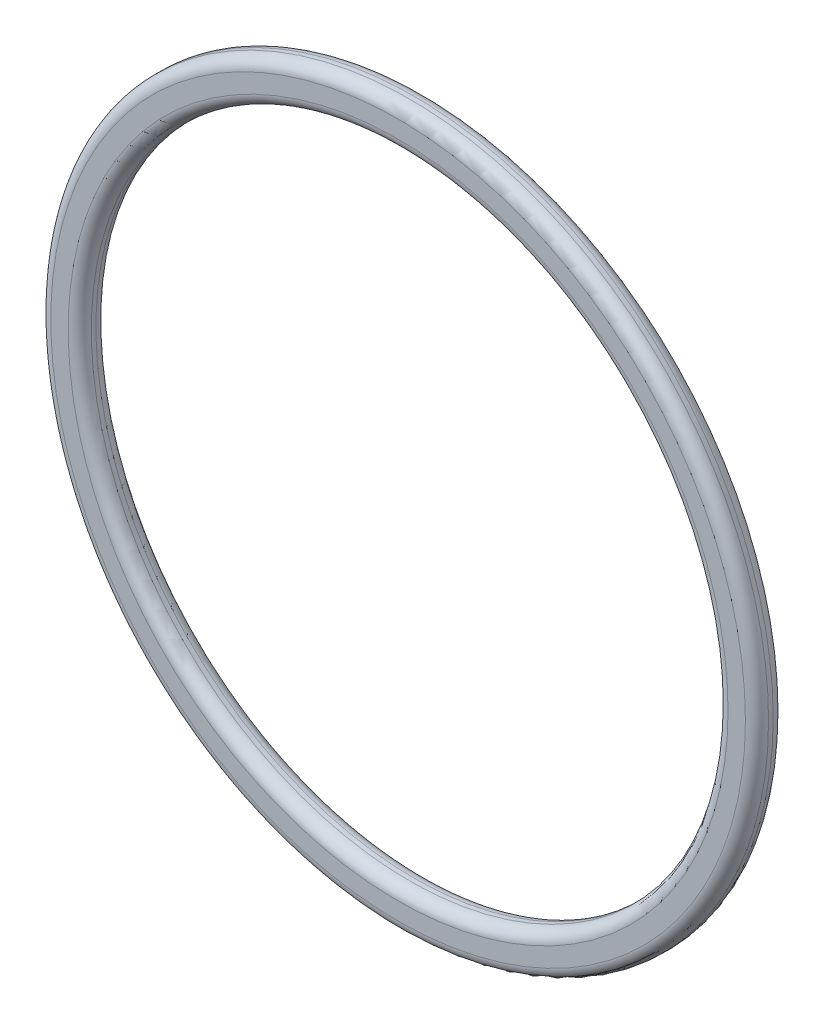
ISO-10303-21;
HEADER;
FILE_DESCRIPTION(('STEP AP214'),'2;1');
FILE_NAME('part.step','',(''),(''),'','','');
FILE_SCHEMA(('AUTOMOTIVE_DESIGN { 1 0 10303 214 1 1 1 1 }'));
ENDSEC;
DATA;
#1=APPLICATION_CONTEXT('core data for automotive mechanical design processes');
#2=APPLICATION_PROTOCOL_DEFINITION('international standard','automotive_design',2000,#1);
#3=PRODUCT_CONTEXT('',#1,'mechanical');
#4=PRODUCT('Part','Part','',(#3));
#5=PRODUCT_RELATED_PRODUCT_CATEGORY('part','',(#4));
#6=PRODUCT_DEFINITION_FORMATION('','',#4);
#7=PRODUCT_DEFINITION_CONTEXT('part definition',#1,'design');
#8=PRODUCT_DEFINITION('design','',#6,#7);
#9=PRODUCT_DEFINITION_SHAPE('','',#8);
#10=(LENGTH_UNIT() NAMED_UNIT(*) SI_UNIT(.MILLI.,.METRE.));
#11=(NAMED_UNIT(*) PLANE_ANGLE_UNIT() SI_UNIT($,.RADIAN.));
#12=(NAMED_UNIT(*) SI_UNIT($,.STERADIAN.) SOLID_ANGLE_UNIT());
#13=UNCERTAINTY_MEASURE_WITH_UNIT(LENGTH_MEASURE(1.E-05),#10,'distance_accuracy_value','');
#14=(GEOMETRIC_REPRESENTATION_CONTEXT(3) GLOBAL_UNCERTAINTY_ASSIGNED_CONTEXT((#13)) GLOBAL_UNIT_ASSIGNED_CONTEXT((#10,
#11,#12)) REPRESENTATION_CONTEXT('',''));
#15=CARTESIAN_POINT('',(0.,0.,0.));
#16=DIRECTION('',(0.,0.,1.));
#17=DIRECTION('',(1.,0.,0.));
#18=AXIS2_PLACEMENT_3D('',#15,#16,#17);
#19=CARTESIAN_POINT('',(0.,0.,-1.85936170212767));
#20=DIRECTION('',(0.,0.,1.));
#21=DIRECTION('',(1.,0.,0.));
#22=AXIS2_PLACEMENT_3D('',#19,#20,#21);
#23=TOROIDAL_SURFACE('',#22,28.5,1.);
#24=CARTESIAN_POINT('',(0.,0.,-2.85936170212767));
#25=DIRECTION('',(0.,0.,1.));
#26=DIRECTION('',(1.,0.,0.));
#27=AXIS2_PLACEMENT_3D('',#24,#25,#26);
#28=CIRCLE('',#27,28.5);
#29=CARTESIAN_POINT('',(28.5,0.,-2.85936170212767));
#30=VERTEX_POINT('',#29);
#31=EDGE_CURVE('E10',#30,#30,#28,.T.);
#32=ORIENTED_EDGE('',*,*,#31,.F.);
#33=EDGE_LOOP('',(#32));
#34=FACE_BOUND('',#33,.T.);
#35=CARTESIAN_POINT('',(0.,0.,-1.85936170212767));
#36=DIRECTION('',(0.,0.,1.));
#37=DIRECTION('',(1.,0.,0.));
#38=AXIS2_PLACEMENT_3D('',#35,#36,#37);
#39=CIRCLE('',#38,27.5);
#40=CARTESIAN_POINT('',(27.5,0.,-1.85936170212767));
#41=VERTEX_POINT('',#40);
#42=EDGE_CURVE('E56',#41,#41,#39,.T.);
#43=ORIENTED_EDGE('',*,*,#42,.T.);
#44=EDGE_LOOP('',(#43));
#45=FACE_BOUND('',#44,.T.);
#46=ADVANCED_FACE('F28',(#34,#45),#23,.T.);
#47=CARTESIAN_POINT('',(0.,30.,-2.85936170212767));
#48=DIRECTION('',(0.,0.,1.));
#49=DIRECTION('',(1.,0.,0.));
#50=AXIS2_PLACEMENT_3D('',#47,#48,#49);
#51=PLANE('',#50);
#52=CARTESIAN_POINT('',(0.,0.,-2.85936170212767));
#53=DIRECTION('',(0.,0.,1.));
#54=DIRECTION('',(1.,0.,0.));
#55=AXIS2_PLACEMENT_3D('',#52,#53,#54);
#56=CIRCLE('',#55,30.);
#57=CARTESIAN_POINT('',(30.,0.,-2.85936170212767));
#58=VERTEX_POINT('',#57);
#59=EDGE_CURVE('E34',#58,#58,#56,.T.);
#60=ORIENTED_EDGE('',*,*,#59,.F.);
#61=EDGE_LOOP('',(#60));
#62=FACE_BOUND('',#61,.T.);
#63=ORIENTED_EDGE('',*,*,#31,.T.);
#64=EDGE_LOOP('',(#63));
#65=FACE_BOUND('',#64,.T.);
#66=ADVANCED_FACE('F93',(#62,#65),#51,.F.);
#67=CARTESIAN_POINT('',(0.,0.,-1.85936170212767));
#68=DIRECTION('',(0.,0.,1.));
#69=DIRECTION('',(1.,0.,0.));
#70=AXIS2_PLACEMENT_3D('',#67,#68,#69);
#71=TOROIDAL_SURFACE('',#70,30.,1.);
#72=CARTESIAN_POINT('',(0.,0.,-1.85936170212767));
#73=DIRECTION('',(0.,0.,1.));
#74=DIRECTION('',(1.,0.,0.));
#75=AXIS2_PLACEMENT_3D('',#72,#73,#74);
#76=CIRCLE('',#75,31.);
#77=CARTESIAN_POINT('',(31.,0.,-1.85936170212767));
#78=VERTEX_POINT('',#77);
#79=EDGE_CURVE('E38',#78,#78,#76,.T.);
#80=ORIENTED_EDGE('',*,*,#79,.F.);
#81=EDGE_LOOP('',(#80));
#82=FACE_BOUND('',#81,.T.);
#83=ORIENTED_EDGE('',*,*,#59,.T.);
#84=EDGE_LOOP('',(#83));
#85=FACE_BOUND('',#84,.T.);
#86=ADVANCED_FACE('F88',(#82,#85),#71,.T.);
#87=CARTESIAN_POINT('',(0.,0.,20.8243971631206));
#88=DIRECTION('',(0.,0.,1.));
#89=DIRECTION('',(1.,0.,0.));
#90=AXIS2_PLACEMENT_3D('',#87,#88,#89);
#91=CYLINDRICAL_SURFACE('',#90,31.);
#92=CARTESIAN_POINT('',(0.,0.,-1.45936170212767));
#93=DIRECTION('',(0.,0.,1.));
#94=DIRECTION('',(1.,0.,0.));
#95=AXIS2_PLACEMENT_3D('',#92,#93,#94);
#96=CIRCLE('',#95,31.);
#97=CARTESIAN_POINT('',(31.,0.,-1.45936170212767));
#98=VERTEX_POINT('',#97);
#99=EDGE_CURVE('E42',#98,#98,#96,.T.);
#100=ORIENTED_EDGE('',*,*,#99,.F.);
#101=EDGE_LOOP('',(#100));
#102=FACE_BOUND('',#101,.T.);
#103=ORIENTED_EDGE('',*,*,#79,.T.);
#104=EDGE_LOOP('',(#103));
#105=FACE_BOUND('',#104,.T.);
#106=ADVANCED_FACE('F82',(#102,#105),#91,.T.);
#107=CARTESIAN_POINT('',(0.,0.,-1.45936170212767));
#108=DIRECTION('',(0.,0.,1.));
#109=DIRECTION('',(1.,0.,0.));
#110=AXIS2_PLACEMENT_3D('',#107,#108,#109);
#111=TOROIDAL_SURFACE('',#110,30.,1.);
#112=CARTESIAN_POINT('',(0.,0.,-0.459361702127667));
#113=DIRECTION('',(0.,0.,1.));
#114=DIRECTION('',(1.,0.,0.));
#115=AXIS2_PLACEMENT_3D('',#112,#113,#114);
#116=CIRCLE('',#115,30.);
#117=CARTESIAN_POINT('',(30.,0.,-0.459361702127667));
#118=VERTEX_POINT('',#117);
#119=EDGE_CURVE('E47',#118,#118,#116,.T.);
#120=ORIENTED_EDGE('',*,*,#119,.F.);
#121=EDGE_LOOP('',(#120));
#122=FACE_BOUND('',#121,.T.);
#123=ORIENTED_EDGE('',*,*,#99,.T.);
#124=EDGE_LOOP('',(#123));
#125=FACE_BOUND('',#124,.T.);
#126=ADVANCED_FACE('F76',(#122,#125),#111,.T.);
#127=CARTESIAN_POINT('',(0.,30.,-0.459361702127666));
#128=DIRECTION('',(0.,0.,-1.));
#129=DIRECTION('',(-1.,0.,0.));
#130=AXIS2_PLACEMENT_3D('',#127,#128,#129);
#131=PLANE('',#130);
#132=CARTESIAN_POINT('',(0.,0.,-0.459361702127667));
#133=DIRECTION('',(0.,0.,1.));
#134=DIRECTION('',(1.,0.,0.));
#135=AXIS2_PLACEMENT_3D('',#132,#133,#134);
#136=CIRCLE('',#135,28.5);
#137=CARTESIAN_POINT('',(28.5,0.,-0.459361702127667));
#138=VERTEX_POINT('',#137);
#139=EDGE_CURVE('E50',#138,#138,#136,.T.);
#140=ORIENTED_EDGE('',*,*,#139,.F.);
#141=EDGE_LOOP('',(#140));
#142=FACE_BOUND('',#141,.T.);
#143=ORIENTED_EDGE('',*,*,#119,.T.);
#144=EDGE_LOOP('',(#143));
#145=FACE_BOUND('',#144,.T.);
#146=ADVANCED_FACE('F70',(#142,#145),#131,.F.);
#147=CARTESIAN_POINT('',(0.,0.,-1.45936170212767));
#148=DIRECTION('',(0.,0.,1.));
#149=DIRECTION('',(1.,0.,0.));
#150=AXIS2_PLACEMENT_3D('',#147,#148,#149);
#151=TOROIDAL_SURFACE('',#150,28.5,1.);
#152=CARTESIAN_POINT('',(0.,0.,-1.45936170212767));
#153=DIRECTION('',(0.,0.,1.));
#154=DIRECTION('',(1.,0.,0.));
#155=AXIS2_PLACEMENT_3D('',#152,#153,#154);
#156=CIRCLE('',#155,27.5);
#157=CARTESIAN_POINT('',(27.5,0.,-1.45936170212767));
#158=VERTEX_POINT('',#157);
#159=EDGE_CURVE('E53',#158,#158,#156,.T.);
#160=ORIENTED_EDGE('',*,*,#159,.F.);
#161=EDGE_LOOP('',(#160));
#162=FACE_BOUND('',#161,.T.);
#163=ORIENTED_EDGE('',*,*,#139,.T.);
#164=EDGE_LOOP('',(#163));
#165=FACE_BOUND('',#164,.T.);
#166=ADVANCED_FACE('F64',(#162,#165),#151,.T.);
#167=CARTESIAN_POINT('',(0.,0.,20.8243971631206));
#168=DIRECTION('',(0.,0.,1.));
#169=DIRECTION('',(1.,0.,0.));
#170=AXIS2_PLACEMENT_3D('',#167,#168,#169);
#171=CYLINDRICAL_SURFACE('',#170,27.5);
#172=ORIENTED_EDGE('',*,*,#42,.F.);
#173=EDGE_LOOP('',(#172));
#174=FACE_BOUND('',#173,.T.);
#175=ORIENTED_EDGE('',*,*,#159,.T.);
#176=EDGE_LOOP('',(#175));
#177=FACE_BOUND('',#176,.T.);
#178=ADVANCED_FACE('F61',(#174,#177),#171,.F.);
#179=CLOSED_SHELL('',(#46,#66,#86,#106,#126,#146,#166,#178));
#180=MANIFOLD_SOLID_BREP('B2',#179);
#181=ADVANCED_BREP_SHAPE_REPRESENTATION('',(#18,#180),#14);
#182=SHAPE_DEFINITION_REPRESENTATION(#9,#181);
ENDSEC;
END-ISO-10303-21;
